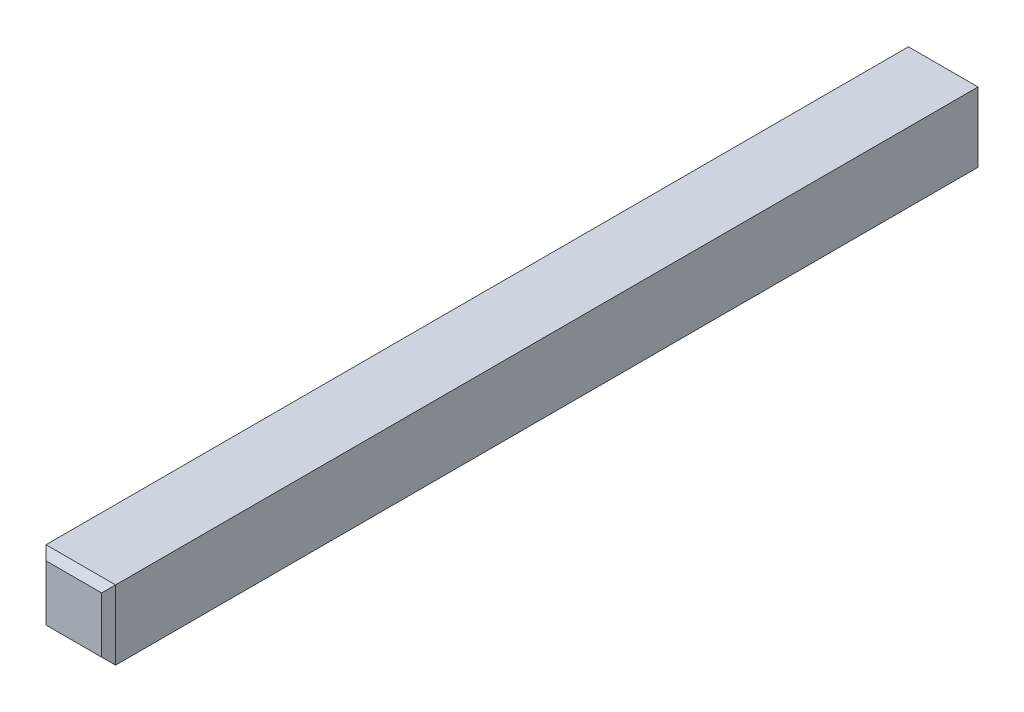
ISO-10303-21;
HEADER;
FILE_DESCRIPTION(('STEP AP214'),'2;1');
FILE_NAME('part.step','',(''),(''),'','','');
FILE_SCHEMA(('AUTOMOTIVE_DESIGN { 1 0 10303 214 1 1 1 1 }'));
ENDSEC;
DATA;
#1=APPLICATION_CONTEXT('core data for automotive mechanical design processes');
#2=APPLICATION_PROTOCOL_DEFINITION('international standard','automotive_design',2000,#1);
#3=PRODUCT_CONTEXT('',#1,'mechanical');
#4=PRODUCT('Part','Part','',(#3));
#5=PRODUCT_RELATED_PRODUCT_CATEGORY('part','',(#4));
#6=PRODUCT_DEFINITION_FORMATION('','',#4);
#7=PRODUCT_DEFINITION_CONTEXT('part definition',#1,'design');
#8=PRODUCT_DEFINITION('design','',#6,#7);
#9=PRODUCT_DEFINITION_SHAPE('','',#8);
#10=(LENGTH_UNIT() NAMED_UNIT(*) SI_UNIT(.MILLI.,.METRE.));
#11=(NAMED_UNIT(*) PLANE_ANGLE_UNIT() SI_UNIT($,.RADIAN.));
#12=(NAMED_UNIT(*) SI_UNIT($,.STERADIAN.) SOLID_ANGLE_UNIT());
#13=UNCERTAINTY_MEASURE_WITH_UNIT(LENGTH_MEASURE(1.E-05),#10,'distance_accuracy_value','');
#14=(GEOMETRIC_REPRESENTATION_CONTEXT(3) GLOBAL_UNCERTAINTY_ASSIGNED_CONTEXT((#13)) GLOBAL_UNIT_ASSIGNED_CONTEXT((#10,
#11,#12)) REPRESENTATION_CONTEXT('',''));
#15=CARTESIAN_POINT('',(0.,0.,0.));
#16=DIRECTION('',(0.,0.,1.));
#17=DIRECTION('',(1.,0.,0.));
#18=AXIS2_PLACEMENT_3D('',#15,#16,#17);
#19=CARTESIAN_POINT('',(2.,-2.,25.));
#20=DIRECTION('',(-1.,0.,0.));
#21=DIRECTION('',(0.,0.,1.));
#22=AXIS2_PLACEMENT_3D('',#19,#20,#21);
#23=PLANE('',#22);
#24=DIRECTION('',(0.,0.,-1.));
#25=VECTOR('',#24,1.);
#26=CARTESIAN_POINT('',(2.,2.,25.));
#27=LINE('',#26,#25);
#28=CARTESIAN_POINT('',(2.,2.,24.6));
#29=VERTEX_POINT('',#28);
#30=CARTESIAN_POINT('',(2.,2.,-25.));
#31=VERTEX_POINT('',#30);
#32=EDGE_CURVE('E84',#29,#31,#27,.T.);
#33=ORIENTED_EDGE('',*,*,#32,.F.);
#34=DIRECTION('',(0.,-1.,0.));
#35=VECTOR('',#34,1.);
#36=CARTESIAN_POINT('',(2.,-2.,24.6));
#37=LINE('',#36,#35);
#38=CARTESIAN_POINT('',(2.,-2.,24.6));
#39=VERTEX_POINT('',#38);
#40=EDGE_CURVE('E11',#29,#39,#37,.T.);
#41=ORIENTED_EDGE('',*,*,#40,.T.);
#42=DIRECTION('',(0.,0.,-1.));
#43=VECTOR('',#42,1.);
#44=CARTESIAN_POINT('',(2.,-2.,25.));
#45=LINE('',#44,#43);
#46=CARTESIAN_POINT('',(2.,-2.,-25.));
#47=VERTEX_POINT('',#46);
#48=EDGE_CURVE('E104',#39,#47,#45,.T.);
#49=ORIENTED_EDGE('',*,*,#48,.T.);
#50=DIRECTION('',(0.,1.,0.));
#51=VECTOR('',#50,1.);
#52=CARTESIAN_POINT('',(2.,-2.,-25.));
#53=LINE('',#52,#51);
#54=EDGE_CURVE('E99',#47,#31,#53,.T.);
#55=ORIENTED_EDGE('',*,*,#54,.T.);
#56=EDGE_LOOP('',(#33,#41,#49,#55));
#57=FACE_BOUND('',#56,.T.);
#58=ADVANCED_FACE('F32',(#57),#23,.F.);
#59=CARTESIAN_POINT('',(-2.,2.,25.));
#60=DIRECTION('',(0.,-1.,0.));
#61=DIRECTION('',(0.,0.,-1.));
#62=AXIS2_PLACEMENT_3D('',#59,#60,#61);
#63=PLANE('',#62);
#64=DIRECTION('',(0.,0.,-1.));
#65=VECTOR('',#64,1.);
#66=CARTESIAN_POINT('',(-2.,2.,25.));
#67=LINE('',#66,#65);
#68=CARTESIAN_POINT('',(-2.,2.,24.6));
#69=VERTEX_POINT('',#68);
#70=CARTESIAN_POINT('',(-2.,2.,-25.));
#71=VERTEX_POINT('',#70);
#72=EDGE_CURVE('E93',#69,#71,#67,.T.);
#73=ORIENTED_EDGE('',*,*,#72,.F.);
#74=DIRECTION('',(1.,0.,0.));
#75=VECTOR('',#74,1.);
#76=CARTESIAN_POINT('',(-2.,2.,24.6));
#77=LINE('',#76,#75);
#78=EDGE_CURVE('E41',#69,#29,#77,.T.);
#79=ORIENTED_EDGE('',*,*,#78,.T.);
#80=ORIENTED_EDGE('',*,*,#32,.T.);
#81=DIRECTION('',(-1.,0.,0.));
#82=VECTOR('',#81,1.);
#83=CARTESIAN_POINT('',(-2.,2.,-25.));
#84=LINE('',#83,#82);
#85=EDGE_CURVE('E87',#31,#71,#84,.T.);
#86=ORIENTED_EDGE('',*,*,#85,.T.);
#87=EDGE_LOOP('',(#73,#79,#80,#86));
#88=FACE_BOUND('',#87,.T.);
#89=ADVANCED_FACE('F86',(#88),#63,.F.);
#90=CARTESIAN_POINT('',(-2.,-2.,25.));
#91=DIRECTION('',(1.,0.,0.));
#92=DIRECTION('',(0.,0.,-1.));
#93=AXIS2_PLACEMENT_3D('',#90,#91,#92);
#94=PLANE('',#93);
#95=DIRECTION('',(0.,0.,-1.));
#96=VECTOR('',#95,1.);
#97=CARTESIAN_POINT('',(-2.,-2.,25.));
#98=LINE('',#97,#96);
#99=CARTESIAN_POINT('',(-2.,-2.,24.6));
#100=VERTEX_POINT('',#99);
#101=CARTESIAN_POINT('',(-2.,-2.,-25.));
#102=VERTEX_POINT('',#101);
#103=EDGE_CURVE('E114',#100,#102,#98,.T.);
#104=ORIENTED_EDGE('',*,*,#103,.F.);
#105=DIRECTION('',(0.,1.,0.));
#106=VECTOR('',#105,1.);
#107=CARTESIAN_POINT('',(-2.,-2.,24.6));
#108=LINE('',#107,#106);
#109=EDGE_CURVE('E56',#100,#69,#108,.T.);
#110=ORIENTED_EDGE('',*,*,#109,.T.);
#111=ORIENTED_EDGE('',*,*,#72,.T.);
#112=DIRECTION('',(0.,-1.,0.));
#113=VECTOR('',#112,1.);
#114=CARTESIAN_POINT('',(-2.,-2.,-25.));
#115=LINE('',#114,#113);
#116=EDGE_CURVE('E101',#71,#102,#115,.T.);
#117=ORIENTED_EDGE('',*,*,#116,.T.);
#118=EDGE_LOOP('',(#104,#110,#111,#117));
#119=FACE_BOUND('',#118,.T.);
#120=ADVANCED_FACE('F152',(#119),#94,.F.);
#121=CARTESIAN_POINT('',(-2.,-2.,25.));
#122=DIRECTION('',(0.,1.,0.));
#123=DIRECTION('',(0.,0.,1.));
#124=AXIS2_PLACEMENT_3D('',#121,#122,#123);
#125=PLANE('',#124);
#126=ORIENTED_EDGE('',*,*,#48,.F.);
#127=DIRECTION('',(-1.,0.,0.));
#128=VECTOR('',#127,1.);
#129=CARTESIAN_POINT('',(-2.,-2.,24.6));
#130=LINE('',#129,#128);
#131=EDGE_CURVE('E125',#39,#100,#130,.T.);
#132=ORIENTED_EDGE('',*,*,#131,.T.);
#133=ORIENTED_EDGE('',*,*,#103,.T.);
#134=DIRECTION('',(1.,0.,0.));
#135=VECTOR('',#134,1.);
#136=CARTESIAN_POINT('',(-2.,-2.,-25.));
#137=LINE('',#136,#135);
#138=EDGE_CURVE('E111',#102,#47,#137,.T.);
#139=ORIENTED_EDGE('',*,*,#138,.T.);
#140=EDGE_LOOP('',(#126,#132,#133,#139));
#141=FACE_BOUND('',#140,.T.);
#142=ADVANCED_FACE('F151',(#141),#125,.F.);
#143=CARTESIAN_POINT('',(0.,0.,25.));
#144=DIRECTION('',(0.,0.,-1.));
#145=DIRECTION('',(-1.,0.,0.));
#146=AXIS2_PLACEMENT_3D('',#143,#144,#145);
#147=PLANE('',#146);
#148=DIRECTION('',(0.,-1.,0.));
#149=VECTOR('',#148,1.);
#150=CARTESIAN_POINT('',(-1.59999999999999,0.,25.));
#151=LINE('',#150,#149);
#152=CARTESIAN_POINT('',(-1.59999999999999,1.6,25.));
#153=VERTEX_POINT('',#152);
#154=CARTESIAN_POINT('',(-1.59999999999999,-1.6,25.));
#155=VERTEX_POINT('',#154);
#156=EDGE_CURVE('E120',#153,#155,#151,.T.);
#157=ORIENTED_EDGE('',*,*,#156,.T.);
#158=DIRECTION('',(1.,0.,0.));
#159=VECTOR('',#158,1.);
#160=CARTESIAN_POINT('',(0.,-1.6,25.));
#161=LINE('',#160,#159);
#162=CARTESIAN_POINT('',(1.6,-1.6,25.));
#163=VERTEX_POINT('',#162);
#164=EDGE_CURVE('E122',#155,#163,#161,.T.);
#165=ORIENTED_EDGE('',*,*,#164,.T.);
#166=DIRECTION('',(0.,1.,0.));
#167=VECTOR('',#166,1.);
#168=CARTESIAN_POINT('',(1.6,0.,25.));
#169=LINE('',#168,#167);
#170=CARTESIAN_POINT('',(1.6,1.6,25.));
#171=VERTEX_POINT('',#170);
#172=EDGE_CURVE('E92',#163,#171,#169,.T.);
#173=ORIENTED_EDGE('',*,*,#172,.T.);
#174=DIRECTION('',(-1.,0.,0.));
#175=VECTOR('',#174,1.);
#176=CARTESIAN_POINT('',(0.,1.6,25.));
#177=LINE('',#176,#175);
#178=EDGE_CURVE('E118',#171,#153,#177,.T.);
#179=ORIENTED_EDGE('',*,*,#178,.T.);
#180=EDGE_LOOP('',(#157,#165,#173,#179));
#181=FACE_BOUND('',#180,.T.);
#182=ADVANCED_FACE('F144',(#181),#147,.F.);
#183=CARTESIAN_POINT('',(0.,0.,-25.));
#184=DIRECTION('',(0.,0.,-1.));
#185=DIRECTION('',(-1.,0.,0.));
#186=AXIS2_PLACEMENT_3D('',#183,#184,#185);
#187=PLANE('',#186);
#188=ORIENTED_EDGE('',*,*,#54,.F.);
#189=ORIENTED_EDGE('',*,*,#138,.F.);
#190=ORIENTED_EDGE('',*,*,#116,.F.);
#191=ORIENTED_EDGE('',*,*,#85,.F.);
#192=EDGE_LOOP('',(#188,#189,#190,#191));
#193=FACE_BOUND('',#192,.T.);
#194=ADVANCED_FACE('F97',(#193),#187,.T.);
#195=CARTESIAN_POINT('',(0.,1.6,25.));
#196=DIRECTION('',(0.,-0.707106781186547,-0.707106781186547));
#197=DIRECTION('',(-1.,0.,0.));
#198=AXIS2_PLACEMENT_3D('',#195,#196,#197);
#199=PLANE('',#198);
#200=DIRECTION('',(-0.577350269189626,-0.577350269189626,0.577350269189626));
#201=VECTOR('',#200,1.);
#202=CARTESIAN_POINT('',(1.06666666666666,1.06666666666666,25.5333333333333));
#203=LINE('',#202,#201);
#204=EDGE_CURVE('E108',#29,#171,#203,.T.);
#205=ORIENTED_EDGE('',*,*,#204,.F.);
#206=ORIENTED_EDGE('',*,*,#78,.F.);
#207=DIRECTION('',(0.577350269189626,-0.577350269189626,0.577350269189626));
#208=VECTOR('',#207,1.);
#209=CARTESIAN_POINT('',(-1.06666666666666,1.06666666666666,25.5333333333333));
#210=LINE('',#209,#208);
#211=EDGE_CURVE('E36',#153,#69,#210,.F.);
#212=ORIENTED_EDGE('',*,*,#211,.F.);
#213=ORIENTED_EDGE('',*,*,#178,.F.);
#214=EDGE_LOOP('',(#205,#206,#212,#213));
#215=FACE_BOUND('',#214,.T.);
#216=ADVANCED_FACE('F34',(#215),#199,.F.);
#217=CARTESIAN_POINT('',(-1.59999999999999,0.,25.));
#218=DIRECTION('',(0.707106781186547,0.,-0.707106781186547));
#219=DIRECTION('',(0.,-1.,0.));
#220=AXIS2_PLACEMENT_3D('',#217,#218,#219);
#221=PLANE('',#220);
#222=ORIENTED_EDGE('',*,*,#211,.T.);
#223=ORIENTED_EDGE('',*,*,#109,.F.);
#224=DIRECTION('',(0.577350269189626,0.577350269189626,0.577350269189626));
#225=VECTOR('',#224,1.);
#226=CARTESIAN_POINT('',(-1.06666666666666,-1.06666666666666,25.5333333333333));
#227=LINE('',#226,#225);
#228=EDGE_CURVE('E132',#155,#100,#227,.F.);
#229=ORIENTED_EDGE('',*,*,#228,.F.);
#230=ORIENTED_EDGE('',*,*,#156,.F.);
#231=EDGE_LOOP('',(#222,#223,#229,#230));
#232=FACE_BOUND('',#231,.T.);
#233=ADVANCED_FACE('F169',(#232),#221,.F.);
#234=CARTESIAN_POINT('',(1.6,0.,25.));
#235=DIRECTION('',(-0.707106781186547,0.,-0.707106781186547));
#236=DIRECTION('',(0.,1.,0.));
#237=AXIS2_PLACEMENT_3D('',#234,#235,#236);
#238=PLANE('',#237);
#239=ORIENTED_EDGE('',*,*,#204,.T.);
#240=ORIENTED_EDGE('',*,*,#172,.F.);
#241=DIRECTION('',(0.577350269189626,-0.577350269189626,-0.577350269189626));
#242=VECTOR('',#241,1.);
#243=CARTESIAN_POINT('',(1.06666666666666,-1.06666666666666,25.5333333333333));
#244=LINE('',#243,#242);
#245=EDGE_CURVE('E130',#39,#163,#244,.F.);
#246=ORIENTED_EDGE('',*,*,#245,.F.);
#247=ORIENTED_EDGE('',*,*,#40,.F.);
#248=EDGE_LOOP('',(#239,#240,#246,#247));
#249=FACE_BOUND('',#248,.T.);
#250=ADVANCED_FACE('F137',(#249),#238,.F.);
#251=CARTESIAN_POINT('',(0.,-1.6,25.));
#252=DIRECTION('',(0.,0.707106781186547,-0.707106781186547));
#253=DIRECTION('',(1.,0.,0.));
#254=AXIS2_PLACEMENT_3D('',#251,#252,#253);
#255=PLANE('',#254);
#256=ORIENTED_EDGE('',*,*,#228,.T.);
#257=ORIENTED_EDGE('',*,*,#131,.F.);
#258=ORIENTED_EDGE('',*,*,#245,.T.);
#259=ORIENTED_EDGE('',*,*,#164,.F.);
#260=EDGE_LOOP('',(#256,#257,#258,#259));
#261=FACE_BOUND('',#260,.T.);
#262=ADVANCED_FACE('F148',(#261),#255,.F.);
#263=CLOSED_SHELL('',(#58,#89,#120,#142,#182,#194,#216,#233,#250,#262));
#264=MANIFOLD_SOLID_BREP('B2',#263);
#265=ADVANCED_BREP_SHAPE_REPRESENTATION('',(#18,#264),#14);
#266=SHAPE_DEFINITION_REPRESENTATION(#9,#265);
ENDSEC;
END-ISO-10303-21;
